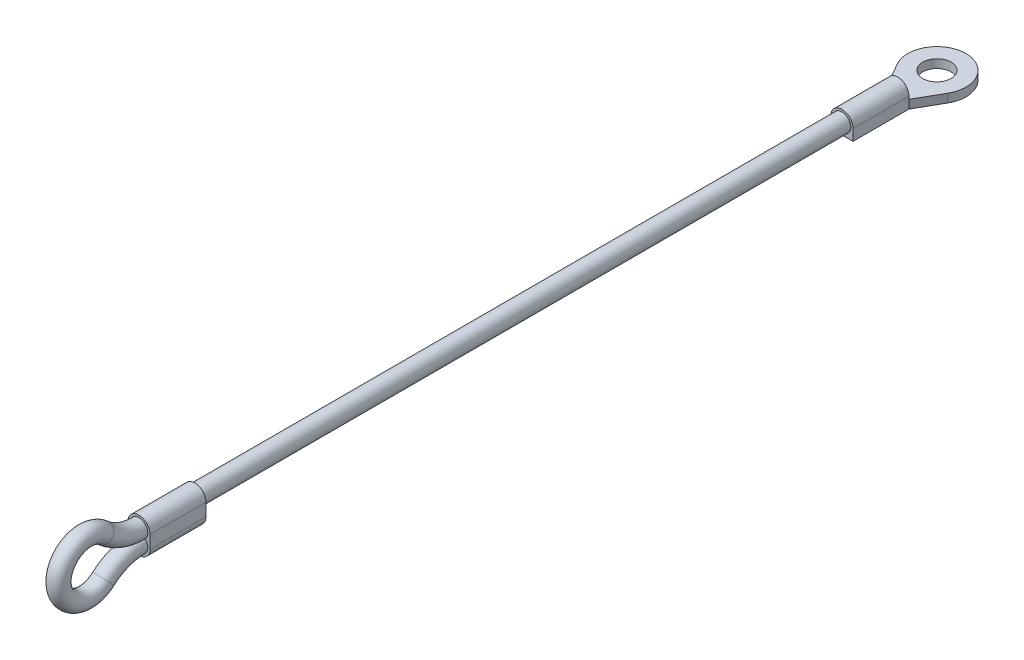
ISO-10303-21;
HEADER;
FILE_DESCRIPTION(('STEP AP214'),'2;1');
FILE_NAME('part.step','',(''),(''),'','','');
FILE_SCHEMA(('AUTOMOTIVE_DESIGN { 1 0 10303 214 1 1 1 1 }'));
ENDSEC;
DATA;
#1=APPLICATION_CONTEXT('core data for automotive mechanical design processes');
#2=APPLICATION_PROTOCOL_DEFINITION('international standard','automotive_design',2000,#1);
#3=PRODUCT_CONTEXT('',#1,'mechanical');
#4=PRODUCT('Part','Part','',(#3));
#5=PRODUCT_RELATED_PRODUCT_CATEGORY('part','',(#4));
#6=PRODUCT_DEFINITION_FORMATION('','',#4);
#7=PRODUCT_DEFINITION_CONTEXT('part definition',#1,'design');
#8=PRODUCT_DEFINITION('design','',#6,#7);
#9=PRODUCT_DEFINITION_SHAPE('','',#8);
#10=(LENGTH_UNIT() NAMED_UNIT(*) SI_UNIT(.MILLI.,.METRE.));
#11=(NAMED_UNIT(*) PLANE_ANGLE_UNIT() SI_UNIT($,.RADIAN.));
#12=(NAMED_UNIT(*) SI_UNIT($,.STERADIAN.) SOLID_ANGLE_UNIT());
#13=UNCERTAINTY_MEASURE_WITH_UNIT(LENGTH_MEASURE(1.E-05),#10,'distance_accuracy_value','');
#14=(GEOMETRIC_REPRESENTATION_CONTEXT(3) GLOBAL_UNCERTAINTY_ASSIGNED_CONTEXT((#13)) GLOBAL_UNIT_ASSIGNED_CONTEXT((#10,
#11,#12)) REPRESENTATION_CONTEXT('',''));
#15=CARTESIAN_POINT('',(0.,0.,0.));
#16=DIRECTION('',(0.,0.,1.));
#17=DIRECTION('',(1.,0.,0.));
#18=AXIS2_PLACEMENT_3D('',#15,#16,#17);
#19=CARTESIAN_POINT('',(0.,0.,-10.));
#20=DIRECTION('',(0.,0.,-1.));
#21=DIRECTION('',(-1.,0.,0.));
#22=AXIS2_PLACEMENT_3D('',#19,#20,#21);
#23=PLANE('',#22);
#24=DIRECTION('',(0.,-1.,0.));
#25=VECTOR('',#24,1.);
#26=CARTESIAN_POINT('',(1.99,0.,-10.));
#27=LINE('',#26,#25);
#28=CARTESIAN_POINT('',(1.99,0.,-10.));
#29=VERTEX_POINT('',#28);
#30=CARTESIAN_POINT('',(1.99,-0.47,-10.));
#31=VERTEX_POINT('',#30);
#32=EDGE_CURVE('E164',#29,#31,#27,.T.);
#33=ORIENTED_EDGE('',*,*,#32,.T.);
#34=DIRECTION('',(-1.,0.,0.));
#35=VECTOR('',#34,1.);
#36=CARTESIAN_POINT('',(-1.99,-0.47,-10.));
#37=LINE('',#36,#35);
#38=CARTESIAN_POINT('',(-1.99,-0.47,-10.));
#39=VERTEX_POINT('',#38);
#40=EDGE_CURVE('E133',#31,#39,#37,.T.);
#41=ORIENTED_EDGE('',*,*,#40,.T.);
#42=DIRECTION('',(0.,1.,0.));
#43=VECTOR('',#42,1.);
#44=CARTESIAN_POINT('',(-1.99,-1.99,-10.));
#45=LINE('',#44,#43);
#46=CARTESIAN_POINT('',(-1.99,0.,-10.));
#47=VERTEX_POINT('',#46);
#48=EDGE_CURVE('E168',#39,#47,#45,.T.);
#49=ORIENTED_EDGE('',*,*,#48,.T.);
#50=CARTESIAN_POINT('',(0.,0.,-10.));
#51=DIRECTION('',(0.,0.,-1.));
#52=DIRECTION('',(-1.,0.,0.));
#53=AXIS2_PLACEMENT_3D('',#50,#51,#52);
#54=CIRCLE('',#53,1.99);
#55=EDGE_CURVE('E161',#47,#29,#54,.T.);
#56=ORIENTED_EDGE('',*,*,#55,.T.);
#57=EDGE_LOOP('',(#33,#41,#49,#56));
#58=FACE_BOUND('',#57,.T.);
#59=ADVANCED_FACE('F33',(#58),#23,.T.);
#60=CARTESIAN_POINT('',(0.,0.,125.8));
#61=DIRECTION('',(0.,0.,-1.));
#62=DIRECTION('',(-1.,0.,0.));
#63=AXIS2_PLACEMENT_3D('',#60,#61,#62);
#64=CYLINDRICAL_SURFACE('',#63,1.59);
#65=CARTESIAN_POINT('',(0.,0.,115.8));
#66=DIRECTION('',(0.,0.,-1.));
#67=DIRECTION('',(0.,1.,0.));
#68=AXIS2_PLACEMENT_3D('',#65,#66,#67);
#69=CIRCLE('',#68,1.59);
#70=CARTESIAN_POINT('',(0.,1.59,115.8));
#71=VERTEX_POINT('',#70);
#72=EDGE_CURVE('E37',#71,#71,#69,.T.);
#73=ORIENTED_EDGE('',*,*,#72,.T.);
#74=EDGE_LOOP('',(#73));
#75=FACE_BOUND('',#74,.T.);
#76=CARTESIAN_POINT('',(0.,0.,0.));
#77=DIRECTION('',(0.,0.,1.));
#78=DIRECTION('',(1.,0.,0.));
#79=AXIS2_PLACEMENT_3D('',#76,#77,#78);
#80=CIRCLE('',#79,1.59);
#81=CARTESIAN_POINT('',(1.59,0.,0.));
#82=VERTEX_POINT('',#81);
#83=EDGE_CURVE('E190',#82,#82,#80,.T.);
#84=ORIENTED_EDGE('',*,*,#83,.T.);
#85=EDGE_LOOP('',(#84));
#86=FACE_BOUND('',#85,.T.);
#87=ADVANCED_FACE('F35',(#75,#86),#64,.T.);
#88=CARTESIAN_POINT('',(0.,1.99637760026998E-12,115.8));
#89=DIRECTION('',(0.,0.,1.));
#90=DIRECTION('',(0.,-1.,0.));
#91=AXIS2_PLACEMENT_3D('',#88,#89,#90);
#92=CYLINDRICAL_SURFACE('',#91,1.99);
#93=CARTESIAN_POINT('',(0.,2.01083362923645E-12,125.8));
#94=DIRECTION('',(0.,0.,-1.));
#95=DIRECTION('',(0.,1.,0.));
#96=AXIS2_PLACEMENT_3D('',#93,#94,#95);
#97=CIRCLE('',#96,1.99);
#98=CARTESIAN_POINT('',(-1.99,2.01107733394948E-12,125.8));
#99=VERTEX_POINT('',#98);
#100=CARTESIAN_POINT('',(1.99,2.01058992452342E-12,125.8));
#101=VERTEX_POINT('',#100);
#102=EDGE_CURVE('E202',#99,#101,#97,.T.);
#103=ORIENTED_EDGE('',*,*,#102,.T.);
#104=DIRECTION('',(0.,0.,1.));
#105=VECTOR('',#104,1.);
#106=CARTESIAN_POINT('',(1.99,1.99613389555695E-12,115.8));
#107=LINE('',#106,#105);
#108=CARTESIAN_POINT('',(1.99,1.99613389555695E-12,115.8));
#109=VERTEX_POINT('',#108);
#110=EDGE_CURVE('E218',#109,#101,#107,.T.);
#111=ORIENTED_EDGE('',*,*,#110,.F.);
#112=CARTESIAN_POINT('',(0.,1.99637760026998E-12,115.8));
#113=DIRECTION('',(0.,0.,-1.));
#114=DIRECTION('',(0.,1.,0.));
#115=AXIS2_PLACEMENT_3D('',#112,#113,#114);
#116=CIRCLE('',#115,1.99);
#117=CARTESIAN_POINT('',(-1.99,1.99662130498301E-12,115.8));
#118=VERTEX_POINT('',#117);
#119=EDGE_CURVE('E191',#118,#109,#116,.T.);
#120=ORIENTED_EDGE('',*,*,#119,.F.);
#121=DIRECTION('',(0.,0.,1.));
#122=VECTOR('',#121,1.);
#123=CARTESIAN_POINT('',(-1.99,1.99662130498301E-12,115.8));
#124=LINE('',#123,#122);
#125=EDGE_CURVE('E201',#118,#99,#124,.T.);
#126=ORIENTED_EDGE('',*,*,#125,.T.);
#127=EDGE_LOOP('',(#103,#111,#120,#126));
#128=FACE_BOUND('',#127,.T.);
#129=ADVANCED_FACE('F244',(#128),#92,.T.);
#130=CARTESIAN_POINT('',(1.99,1.99613389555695E-12,115.8));
#131=DIRECTION('',(-1.,0.,0.));
#132=DIRECTION('',(0.,-1.,0.));
#133=AXIS2_PLACEMENT_3D('',#130,#131,#132);
#134=PLANE('',#133);
#135=DIRECTION('',(0.,-1.,0.));
#136=VECTOR('',#135,1.);
#137=CARTESIAN_POINT('',(1.99,2.01058992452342E-12,125.8));
#138=LINE('',#137,#136);
#139=CARTESIAN_POINT('',(1.99,-2.26625258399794,125.8));
#140=VERTEX_POINT('',#139);
#141=EDGE_CURVE('E205',#101,#140,#138,.T.);
#142=ORIENTED_EDGE('',*,*,#141,.T.);
#143=DIRECTION('',(0.,0.,1.));
#144=VECTOR('',#143,1.);
#145=CARTESIAN_POINT('',(1.99,-2.26625258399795,115.8));
#146=LINE('',#145,#144);
#147=CARTESIAN_POINT('',(1.99,-2.26625258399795,115.8));
#148=VERTEX_POINT('',#147);
#149=EDGE_CURVE('E215',#148,#140,#146,.T.);
#150=ORIENTED_EDGE('',*,*,#149,.F.);
#151=DIRECTION('',(0.,-1.,0.));
#152=VECTOR('',#151,1.);
#153=CARTESIAN_POINT('',(1.99,1.99613389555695E-12,115.8));
#154=LINE('',#153,#152);
#155=EDGE_CURVE('E194',#109,#148,#154,.T.);
#156=ORIENTED_EDGE('',*,*,#155,.F.);
#157=ORIENTED_EDGE('',*,*,#110,.T.);
#158=EDGE_LOOP('',(#142,#150,#156,#157));
#159=FACE_BOUND('',#158,.T.);
#160=ADVANCED_FACE('F296',(#159),#134,.F.);
#161=CARTESIAN_POINT('',(0.,-2.26625258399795,115.8));
#162=DIRECTION('',(0.,0.,1.));
#163=DIRECTION('',(0.,-1.,0.));
#164=AXIS2_PLACEMENT_3D('',#161,#162,#163);
#165=CYLINDRICAL_SURFACE('',#164,1.99);
#166=CARTESIAN_POINT('',(0.,-2.26625258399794,125.8));
#167=DIRECTION('',(0.,0.,-1.));
#168=DIRECTION('',(0.,1.,0.));
#169=AXIS2_PLACEMENT_3D('',#166,#167,#168);
#170=CIRCLE('',#169,1.99);
#171=CARTESIAN_POINT('',(-1.99,-2.26625258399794,125.8));
#172=VERTEX_POINT('',#171);
#173=EDGE_CURVE('E207',#140,#172,#170,.T.);
#174=ORIENTED_EDGE('',*,*,#173,.T.);
#175=DIRECTION('',(0.,0.,1.));
#176=VECTOR('',#175,1.);
#177=CARTESIAN_POINT('',(-1.99,-2.26625258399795,115.8));
#178=LINE('',#177,#176);
#179=CARTESIAN_POINT('',(-1.99,-2.26625258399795,115.8));
#180=VERTEX_POINT('',#179);
#181=EDGE_CURVE('E212',#180,#172,#178,.T.);
#182=ORIENTED_EDGE('',*,*,#181,.F.);
#183=CARTESIAN_POINT('',(0.,-2.26625258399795,115.8));
#184=DIRECTION('',(0.,0.,-1.));
#185=DIRECTION('',(0.,1.,0.));
#186=AXIS2_PLACEMENT_3D('',#183,#184,#185);
#187=CIRCLE('',#186,1.99);
#188=EDGE_CURVE('E197',#148,#180,#187,.T.);
#189=ORIENTED_EDGE('',*,*,#188,.F.);
#190=ORIENTED_EDGE('',*,*,#149,.T.);
#191=EDGE_LOOP('',(#174,#182,#189,#190));
#192=FACE_BOUND('',#191,.T.);
#193=ADVANCED_FACE('F293',(#192),#165,.T.);
#194=CARTESIAN_POINT('',(-1.99,1.99662130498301E-12,115.8));
#195=DIRECTION('',(1.,0.,0.));
#196=DIRECTION('',(0.,1.,0.));
#197=AXIS2_PLACEMENT_3D('',#194,#195,#196);
#198=PLANE('',#197);
#199=DIRECTION('',(0.,1.,0.));
#200=VECTOR('',#199,1.);
#201=CARTESIAN_POINT('',(-1.99,2.01107733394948E-12,125.8));
#202=LINE('',#201,#200);
#203=EDGE_CURVE('E195',#172,#99,#202,.T.);
#204=ORIENTED_EDGE('',*,*,#203,.T.);
#205=ORIENTED_EDGE('',*,*,#125,.F.);
#206=DIRECTION('',(0.,1.,0.));
#207=VECTOR('',#206,1.);
#208=CARTESIAN_POINT('',(-1.99,1.99662130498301E-12,115.8));
#209=LINE('',#208,#207);
#210=EDGE_CURVE('E199',#180,#118,#209,.T.);
#211=ORIENTED_EDGE('',*,*,#210,.F.);
#212=ORIENTED_EDGE('',*,*,#181,.T.);
#213=EDGE_LOOP('',(#204,#205,#211,#212));
#214=FACE_BOUND('',#213,.T.);
#215=ADVANCED_FACE('F288',(#214),#198,.F.);
#216=CARTESIAN_POINT('',(0.,1.99637760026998E-12,115.8));
#217=DIRECTION('',(0.,0.,-1.));
#218=DIRECTION('',(0.,1.,0.));
#219=AXIS2_PLACEMENT_3D('',#216,#217,#218);
#220=PLANE('',#219);
#221=ORIENTED_EDGE('',*,*,#72,.F.);
#222=EDGE_LOOP('',(#221));
#223=FACE_BOUND('',#222,.T.);
#224=ORIENTED_EDGE('',*,*,#119,.T.);
#225=ORIENTED_EDGE('',*,*,#155,.T.);
#226=ORIENTED_EDGE('',*,*,#188,.T.);
#227=ORIENTED_EDGE('',*,*,#210,.T.);
#228=EDGE_LOOP('',(#224,#225,#226,#227));
#229=FACE_BOUND('',#228,.T.);
#230=ADVANCED_FACE('F255',(#223,#229),#220,.T.);
#231=CARTESIAN_POINT('',(0.,2.01083362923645E-12,125.8));
#232=DIRECTION('',(0.,0.,-1.));
#233=DIRECTION('',(0.,1.,0.));
#234=AXIS2_PLACEMENT_3D('',#231,#232,#233);
#235=PLANE('',#234);
#236=CARTESIAN_POINT('',(0.,0.,125.8));
#237=DIRECTION('',(0.,0.,1.));
#238=DIRECTION('',(1.,0.,0.));
#239=AXIS2_PLACEMENT_3D('',#236,#237,#238);
#240=CIRCLE('',#239,1.59);
#241=CARTESIAN_POINT('',(1.11540342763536,-1.13312629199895,125.8));
#242=VERTEX_POINT('',#241);
#243=CARTESIAN_POINT('',(-1.11540342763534,-1.13312629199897,125.8));
#244=VERTEX_POINT('',#243);
#245=EDGE_CURVE('E42',#242,#244,#240,.T.);
#246=ORIENTED_EDGE('',*,*,#245,.F.);
#247=CARTESIAN_POINT('',(0.,-2.26625258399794,125.8));
#248=DIRECTION('',(0.,0.,-1.));
#249=DIRECTION('',(1.,0.,0.));
#250=AXIS2_PLACEMENT_3D('',#247,#248,#249);
#251=CIRCLE('',#250,1.59);
#252=EDGE_CURVE('E56',#242,#244,#251,.T.);
#253=ORIENTED_EDGE('',*,*,#252,.T.);
#254=EDGE_LOOP('',(#246,#253));
#255=FACE_BOUND('',#254,.T.);
#256=ORIENTED_EDGE('',*,*,#102,.F.);
#257=ORIENTED_EDGE('',*,*,#203,.F.);
#258=ORIENTED_EDGE('',*,*,#173,.F.);
#259=ORIENTED_EDGE('',*,*,#141,.F.);
#260=EDGE_LOOP('',(#256,#257,#258,#259));
#261=FACE_BOUND('',#260,.T.);
#262=ADVANCED_FACE('F248',(#255,#261),#235,.F.);
#263=CARTESIAN_POINT('',(0.,-1.13312629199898,135.4));
#264=DIRECTION('',(-1.,0.,0.));
#265=DIRECTION('',(0.,0.,1.));
#266=AXIS2_PLACEMENT_3D('',#263,#264,#265);
#267=TOROIDAL_SURFACE('',#266,4.8,1.59);
#268=CARTESIAN_POINT('',(0.,-4.71083505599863,132.2));
#269=DIRECTION('',(0.,0.666666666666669,-0.745355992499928));
#270=DIRECTION('',(1.,0.,0.));
#271=AXIS2_PLACEMENT_3D('',#268,#269,#270);
#272=CIRCLE('',#271,1.59);
#273=CARTESIAN_POINT('',(0.,-5.89595108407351,131.14));
#274=VERTEX_POINT('',#273);
#275=EDGE_CURVE('E222',#274,#274,#272,.T.);
#276=CARTESIAN_POINT('',(0.,2.44458247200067,132.2));
#277=DIRECTION('',(0.,0.666666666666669,0.745355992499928));
#278=DIRECTION('',(1.,0.,0.));
#279=AXIS2_PLACEMENT_3D('',#276,#277,#278);
#280=CIRCLE('',#279,1.59);
#281=CARTESIAN_POINT('',(0.,3.62969850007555,131.14));
#282=VERTEX_POINT('',#281);
#283=EDGE_CURVE('E225',#282,#282,#280,.T.);
#284=CARTESIAN_POINT('',(0.,-1.13312629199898,135.4));
#285=DIRECTION('',(-1.,0.,0.));
#286=DIRECTION('',(0.,0.,1.));
#287=AXIS2_PLACEMENT_3D('',#284,#285,#286);
#288=CIRCLE('',#287,6.39);
#289=EDGE_CURVE('',#274,#282,#288,.T.);
#290=ORIENTED_EDGE('',*,*,#275,.F.);
#291=ORIENTED_EDGE('',*,*,#283,.T.);
#292=ORIENTED_EDGE('',*,*,#289,.T.);
#293=ORIENTED_EDGE('',*,*,#289,.F.);
#294=EDGE_LOOP('',(#290,#292,#291,#293));
#295=FACE_BOUND('',#294,.T.);
#296=ADVANCED_FACE('F246',(#295),#267,.T.);
#297=CARTESIAN_POINT('',(0.,9.6,125.8));
#298=DIRECTION('',(1.,0.,0.));
#299=DIRECTION('',(0.,0.,-1.));
#300=AXIS2_PLACEMENT_3D('',#297,#298,#299);
#301=TOROIDAL_SURFACE('',#300,9.6,1.59);
#302=ORIENTED_EDGE('',*,*,#283,.F.);
#303=EDGE_LOOP('',(#302));
#304=FACE_BOUND('',#303,.T.);
#305=CARTESIAN_POINT('',(1.11540342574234,-1.13312629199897,125.7998));
#306=CARTESIAN_POINT('',(1.11534851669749,-1.13312629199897,125.92773673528));
#307=CARTESIAN_POINT('',(1.1130814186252,-1.13312629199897,126.055686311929));
#308=CARTESIAN_POINT('',(1.10371453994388,-1.13312629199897,126.31155828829));
#309=CARTESIAN_POINT('',(1.09660901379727,-1.13312629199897,126.43948047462));
#310=CARTESIAN_POINT('',(1.0770425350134,-1.13312629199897,126.696418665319));
#311=CARTESIAN_POINT('',(1.06452051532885,-1.13312629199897,126.825430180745));
#312=CARTESIAN_POINT('',(1.03319430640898,-1.13312629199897,127.082627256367));
#313=CARTESIAN_POINT('',(1.01439338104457,-1.13312629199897,127.210813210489));
#314=CARTESIAN_POINT('',(0.966908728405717,-1.13312629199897,127.478005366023));
#315=CARTESIAN_POINT('',(0.937456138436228,-1.13312629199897,127.616883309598));
#316=CARTESIAN_POINT('',(0.883915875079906,-1.13312629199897,127.82263125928));
#317=CARTESIAN_POINT('',(0.864530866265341,-1.13312629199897,127.890724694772));
#318=CARTESIAN_POINT('',(0.82199602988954,-1.13312629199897,128.025715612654));
#319=CARTESIAN_POINT('',(0.79884765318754,-1.13312629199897,128.092613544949));
#320=CARTESIAN_POINT('',(0.744519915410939,-1.13312629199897,128.233542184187));
#321=CARTESIAN_POINT('',(0.712679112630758,-1.13312629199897,128.307321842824));
#322=CARTESIAN_POINT('',(0.641279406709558,-1.13312629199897,128.451146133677));
#323=CARTESIAN_POINT('',(0.601727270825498,-1.13312629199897,128.521193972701));
#324=CARTESIAN_POINT('',(0.528948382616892,-1.13312629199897,128.62943568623));
#325=CARTESIAN_POINT('',(0.498892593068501,-1.13312629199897,128.669741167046));
#326=CARTESIAN_POINT('',(0.433770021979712,-1.13312629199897,128.746140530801));
#327=CARTESIAN_POINT('',(0.398710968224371,-1.13312629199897,128.782240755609));
#328=CARTESIAN_POINT('',(0.335060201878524,-1.13312629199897,128.837058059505));
#329=CARTESIAN_POINT('',(0.308066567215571,-1.13312629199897,128.857612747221));
#330=CARTESIAN_POINT('',(0.251279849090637,-1.13312629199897,128.894433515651));
#331=CARTESIAN_POINT('',(0.22149152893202,-1.13312629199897,128.910706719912));
#332=CARTESIAN_POINT('',(0.165682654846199,-1.13312629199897,128.934797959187));
#333=CARTESIAN_POINT('',(0.140117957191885,-1.13312629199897,128.943660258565));
#334=CARTESIAN_POINT('',(0.0878641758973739,-1.13312629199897,128.956990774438));
#335=CARTESIAN_POINT('',(0.0611762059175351,-1.13312629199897,128.961463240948));
#336=CARTESIAN_POINT('',(0.00731772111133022,-1.13312629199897,128.965572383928));
#337=CARTESIAN_POINT('',(-0.0198542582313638,-1.13312629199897,128.965190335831));
#338=CARTESIAN_POINT('',(-0.0736951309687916,-1.13312629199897,128.959586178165));
#339=CARTESIAN_POINT('',(-0.100363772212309,-1.13312629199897,128.954361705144));
#340=CARTESIAN_POINT('',(-0.151195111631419,-1.13312629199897,128.939957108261));
#341=CARTESIAN_POINT('',(-0.175416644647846,-1.13312629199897,128.930979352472));
#342=CARTESIAN_POINT('',(-0.222373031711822,-1.13312629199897,128.909774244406));
#343=CARTESIAN_POINT('',(-0.245107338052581,-1.13312629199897,128.897545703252));
#344=CARTESIAN_POINT('',(-0.304759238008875,-1.13312629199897,128.860748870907));
#345=CARTESIAN_POINT('',(-0.340101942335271,-1.13312629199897,128.833635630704));
#346=CARTESIAN_POINT('',(-0.40628124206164,-1.13312629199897,128.77436880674));
#347=CARTESIAN_POINT('',(-0.437102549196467,-1.13312629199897,128.742198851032));
#348=CARTESIAN_POINT('',(-0.492718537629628,-1.13312629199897,128.67701365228));
#349=CARTESIAN_POINT('',(-0.517788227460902,-1.13312629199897,128.644229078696));
#350=CARTESIAN_POINT('',(-0.565060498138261,-1.13312629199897,128.576639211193));
#351=CARTESIAN_POINT('',(-0.587260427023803,-1.13312629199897,128.541832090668));
#352=CARTESIAN_POINT('',(-0.65027575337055,-1.13312629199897,128.435150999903));
#353=CARTESIAN_POINT('',(-0.687428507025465,-1.13312629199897,128.361116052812));
#354=CARTESIAN_POINT('',(-0.745434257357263,-1.13312629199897,128.230275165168));
#355=CARTESIAN_POINT('',(-0.767985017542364,-1.13312629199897,128.174182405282));
#356=CARTESIAN_POINT('',(-0.809859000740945,-1.13312629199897,128.060796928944));
#357=CARTESIAN_POINT('',(-0.82918188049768,-1.13312629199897,128.003504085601));
#358=CARTESIAN_POINT('',(-0.88316624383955,-1.13312629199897,127.830173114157));
#359=CARTESIAN_POINT('',(-0.913763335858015,-1.13312629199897,127.712874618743));
#360=CARTESIAN_POINT('',(-0.967023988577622,-1.13312629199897,127.475955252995));
#361=CARTESIAN_POINT('',(-0.989647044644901,-1.13312629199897,127.356325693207));
#362=CARTESIAN_POINT('',(-1.0284586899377,-1.13312629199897,127.116012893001));
#363=CARTESIAN_POINT('',(-1.0446457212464,-1.13312629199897,126.995329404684));
#364=CARTESIAN_POINT('',(-1.06818793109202,-1.13312629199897,126.78453669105));
#365=CARTESIAN_POINT('',(-1.07674400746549,-1.13312629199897,126.694556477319));
#366=CARTESIAN_POINT('',(-1.09119671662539,-1.13312629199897,126.514367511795));
#367=CARTESIAN_POINT('',(-1.09709289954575,-1.13312629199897,126.424158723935));
#368=CARTESIAN_POINT('',(-1.10635885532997,-1.13312629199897,126.244939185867));
#369=CARTESIAN_POINT('',(-1.10976438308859,-1.13312629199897,126.155930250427));
#370=CARTESIAN_POINT('',(-1.11428069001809,-1.13312629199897,125.977880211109));
#371=CARTESIAN_POINT('',(-1.11539214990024,-1.13312629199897,125.888839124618));
#372=CARTESIAN_POINT('',(-1.11540342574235,-1.13312629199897,125.7998));
#373=B_SPLINE_CURVE_WITH_KNOTS('',3,(#305,#306,#307,#308,#309,#310,#311,#312,#313,#314,#315,
#316,#317,#318,#319,#320,#321,#322,#323,#324,#325,#326,#327,#328,#329,#330,#331,#332,#333,#334,
#335,#336,#337,#338,#339,#340,#341,#342,#343,#344,#345,#346,#347,#348,#349,#350,#351,#352,#353,
#354,#355,#356,#357,#358,#359,#360,#361,#362,#363,#364,#365,#366,#367,#368,#369,#370,#371,#372),
.UNSPECIFIED.,.F.,.F.,(4,2,2,2,2,2,2,2,2,2,2,2,2,2,2,2,2,2,2,2,2,2,2,2,2,2,2,2,2,2,2,2,2,4),(0.,
0.383810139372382,0.76807684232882,1.1567936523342,1.54530871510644,1.9707126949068,
2.18302701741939,2.39525968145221,2.63604166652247,2.87661329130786,3.02716706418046,
3.17749076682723,3.27898827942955,3.38031583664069,3.461157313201,3.54192044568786,
3.62299518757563,3.70410952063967,3.78132200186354,3.85856276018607,3.99142265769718,
4.12472192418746,4.24834991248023,4.37209134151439,4.61994843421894,4.80123584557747,
4.98254252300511,5.34577733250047,5.71083149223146,6.07597396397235,6.34709439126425,
6.61826065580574,6.88545336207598,7.15256677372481),.UNSPECIFIED.);
#374=EDGE_CURVE('E11',#242,#244,#373,.T.);
#375=ORIENTED_EDGE('',*,*,#374,.F.);
#376=ORIENTED_EDGE('',*,*,#245,.T.);
#377=EDGE_LOOP('',(#375,#376));
#378=FACE_BOUND('',#377,.T.);
#379=ADVANCED_FACE('F235',(#304,#378),#301,.T.);
#380=CARTESIAN_POINT('',(0.,-11.8662525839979,125.8));
#381=DIRECTION('',(1.,0.,0.));
#382=DIRECTION('',(0.,0.,-1.));
#383=AXIS2_PLACEMENT_3D('',#380,#381,#382);
#384=TOROIDAL_SURFACE('',#383,9.6,1.59);
#385=ORIENTED_EDGE('',*,*,#275,.T.);
#386=EDGE_LOOP('',(#385));
#387=FACE_BOUND('',#386,.T.);
#388=ORIENTED_EDGE('',*,*,#252,.F.);
#389=ORIENTED_EDGE('',*,*,#374,.T.);
#390=EDGE_LOOP('',(#388,#389));
#391=FACE_BOUND('',#390,.T.);
#392=ADVANCED_FACE('F238',(#387,#391),#384,.T.);
#393=CARTESIAN_POINT('',(0.,0.,-10.));
#394=DIRECTION('',(0.,0.,1.));
#395=DIRECTION('',(1.,0.,0.));
#396=AXIS2_PLACEMENT_3D('',#393,#394,#395);
#397=CYLINDRICAL_SURFACE('',#396,1.99);
#398=CARTESIAN_POINT('',(0.,0.,0.));
#399=DIRECTION('',(0.,0.,-1.));
#400=DIRECTION('',(-1.,0.,0.));
#401=AXIS2_PLACEMENT_3D('',#398,#399,#400);
#402=CIRCLE('',#401,1.99);
#403=CARTESIAN_POINT('',(-1.99,0.,0.));
#404=VERTEX_POINT('',#403);
#405=CARTESIAN_POINT('',(1.99,0.,0.));
#406=VERTEX_POINT('',#405);
#407=EDGE_CURVE('E159',#404,#406,#402,.T.);
#408=ORIENTED_EDGE('',*,*,#407,.T.);
#409=DIRECTION('',(0.,0.,1.));
#410=VECTOR('',#409,1.);
#411=CARTESIAN_POINT('',(1.99,0.,-10.));
#412=LINE('',#411,#410);
#413=EDGE_CURVE('E187',#29,#406,#412,.T.);
#414=ORIENTED_EDGE('',*,*,#413,.F.);
#415=ORIENTED_EDGE('',*,*,#55,.F.);
#416=DIRECTION('',(0.,0.,1.));
#417=VECTOR('',#416,1.);
#418=CARTESIAN_POINT('',(-1.99,0.,-10.));
#419=LINE('',#418,#417);
#420=EDGE_CURVE('E170',#47,#404,#419,.T.);
#421=ORIENTED_EDGE('',*,*,#420,.T.);
#422=EDGE_LOOP('',(#408,#414,#415,#421));
#423=FACE_BOUND('',#422,.T.);
#424=ADVANCED_FACE('F242',(#423),#397,.T.);
#425=CARTESIAN_POINT('',(1.99,0.,-10.));
#426=DIRECTION('',(-1.,0.,0.));
#427=DIRECTION('',(0.,-1.,0.));
#428=AXIS2_PLACEMENT_3D('',#425,#426,#427);
#429=PLANE('',#428);
#430=DIRECTION('',(0.,-1.,0.));
#431=VECTOR('',#430,1.);
#432=CARTESIAN_POINT('',(1.99,0.,0.));
#433=LINE('',#432,#431);
#434=CARTESIAN_POINT('',(1.99,-1.99,0.));
#435=VERTEX_POINT('',#434);
#436=EDGE_CURVE('E173',#406,#435,#433,.T.);
#437=ORIENTED_EDGE('',*,*,#436,.T.);
#438=DIRECTION('',(0.,0.,1.));
#439=VECTOR('',#438,1.);
#440=CARTESIAN_POINT('',(1.99,-1.99,-10.));
#441=LINE('',#440,#439);
#442=CARTESIAN_POINT('',(1.99,-1.99,-10.));
#443=VERTEX_POINT('',#442);
#444=EDGE_CURVE('E184',#443,#435,#441,.T.);
#445=ORIENTED_EDGE('',*,*,#444,.F.);
#446=DIRECTION('',(0.,-1.,0.));
#447=VECTOR('',#446,1.);
#448=CARTESIAN_POINT('',(1.99,-0.47,-10.));
#449=LINE('',#448,#447);
#450=EDGE_CURVE('E157',#31,#443,#449,.T.);
#451=ORIENTED_EDGE('',*,*,#450,.F.);
#452=ORIENTED_EDGE('',*,*,#32,.F.);
#453=ORIENTED_EDGE('',*,*,#413,.T.);
#454=EDGE_LOOP('',(#437,#445,#451,#452,#453));
#455=FACE_BOUND('',#454,.T.);
#456=ADVANCED_FACE('F279',(#455),#429,.F.);
#457=CARTESIAN_POINT('',(0.,-1.99,-10.));
#458=DIRECTION('',(0.,1.,0.));
#459=DIRECTION('',(0.,0.,1.));
#460=AXIS2_PLACEMENT_3D('',#457,#458,#459);
#461=PLANE('',#460);
#462=DIRECTION('',(-1.,0.,0.));
#463=VECTOR('',#462,1.);
#464=CARTESIAN_POINT('',(0.,-1.99,0.));
#465=LINE('',#464,#463);
#466=CARTESIAN_POINT('',(-1.99,-1.99,0.));
#467=VERTEX_POINT('',#466);
#468=EDGE_CURVE('E176',#435,#467,#465,.T.);
#469=ORIENTED_EDGE('',*,*,#468,.T.);
#470=DIRECTION('',(0.,0.,1.));
#471=VECTOR('',#470,1.);
#472=CARTESIAN_POINT('',(-1.99,-1.99,-10.));
#473=LINE('',#472,#471);
#474=CARTESIAN_POINT('',(-1.99,-1.99,-10.));
#475=VERTEX_POINT('',#474);
#476=EDGE_CURVE('E181',#475,#467,#473,.T.);
#477=ORIENTED_EDGE('',*,*,#476,.F.);
#478=DIRECTION('',(-0.496859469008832,0.,-0.867831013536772));
#479=VECTOR('',#478,1.);
#480=CARTESIAN_POINT('',(-4.5170604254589,-1.99,-14.413846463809));
#481=LINE('',#480,#479);
#482=CARTESIAN_POINT('',(-4.5170604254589,-1.99,-14.413846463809));
#483=VERTEX_POINT('',#482);
#484=EDGE_CURVE('E153',#475,#483,#481,.T.);
#485=ORIENTED_EDGE('',*,*,#484,.T.);
#486=CARTESIAN_POINT('',(0.,-1.99,-17.));
#487=DIRECTION('',(0.,-1.,0.));
#488=DIRECTION('',(0.,0.,1.));
#489=AXIS2_PLACEMENT_3D('',#486,#487,#488);
#490=CIRCLE('',#489,5.205);
#491=CARTESIAN_POINT('',(4.5170604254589,-1.99,-14.413846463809));
#492=VERTEX_POINT('',#491);
#493=EDGE_CURVE('E129',#483,#492,#490,.T.);
#494=ORIENTED_EDGE('',*,*,#493,.T.);
#495=DIRECTION('',(-0.496859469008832,0.,0.867831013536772));
#496=VECTOR('',#495,1.);
#497=CARTESIAN_POINT('',(1.99,-1.99,-10.));
#498=LINE('',#497,#496);
#499=EDGE_CURVE('E143',#492,#443,#498,.T.);
#500=ORIENTED_EDGE('',*,*,#499,.T.);
#501=ORIENTED_EDGE('',*,*,#444,.T.);
#502=EDGE_LOOP('',(#469,#477,#485,#494,#500,#501));
#503=FACE_BOUND('',#502,.T.);
#504=CARTESIAN_POINT('',(0.,-1.99,-17.));
#505=DIRECTION('',(0.,-1.,0.));
#506=DIRECTION('',(0.,0.,-1.));
#507=AXIS2_PLACEMENT_3D('',#504,#505,#506);
#508=CIRCLE('',#507,2.54);
#509=CARTESIAN_POINT('',(0.,-1.99,-19.54));
#510=VERTEX_POINT('',#509);
#511=EDGE_CURVE('E148',#510,#510,#508,.T.);
#512=ORIENTED_EDGE('',*,*,#511,.F.);
#513=EDGE_LOOP('',(#512));
#514=FACE_BOUND('',#513,.T.);
#515=ADVANCED_FACE('F275',(#503,#514),#461,.F.);
#516=CARTESIAN_POINT('',(-1.99,-1.99,-10.));
#517=DIRECTION('',(1.,0.,0.));
#518=DIRECTION('',(0.,1.,0.));
#519=AXIS2_PLACEMENT_3D('',#516,#517,#518);
#520=PLANE('',#519);
#521=DIRECTION('',(0.,1.,0.));
#522=VECTOR('',#521,1.);
#523=CARTESIAN_POINT('',(-1.99,-1.99,0.));
#524=LINE('',#523,#522);
#525=EDGE_CURVE('E165',#467,#404,#524,.T.);
#526=ORIENTED_EDGE('',*,*,#525,.T.);
#527=ORIENTED_EDGE('',*,*,#420,.F.);
#528=ORIENTED_EDGE('',*,*,#48,.F.);
#529=EDGE_CURVE('E141',#475,#39,#45,.T.);
#530=ORIENTED_EDGE('',*,*,#529,.F.);
#531=ORIENTED_EDGE('',*,*,#476,.T.);
#532=EDGE_LOOP('',(#526,#527,#528,#530,#531));
#533=FACE_BOUND('',#532,.T.);
#534=ADVANCED_FACE('F271',(#533),#520,.F.);
#535=CARTESIAN_POINT('',(0.,0.,0.));
#536=DIRECTION('',(0.,0.,-1.));
#537=DIRECTION('',(-1.,0.,0.));
#538=AXIS2_PLACEMENT_3D('',#535,#536,#537);
#539=PLANE('',#538);
#540=ORIENTED_EDGE('',*,*,#83,.F.);
#541=EDGE_LOOP('',(#540));
#542=FACE_BOUND('',#541,.T.);
#543=ORIENTED_EDGE('',*,*,#407,.F.);
#544=ORIENTED_EDGE('',*,*,#525,.F.);
#545=ORIENTED_EDGE('',*,*,#468,.F.);
#546=ORIENTED_EDGE('',*,*,#436,.F.);
#547=EDGE_LOOP('',(#543,#544,#545,#546));
#548=FACE_BOUND('',#547,.T.);
#549=ADVANCED_FACE('F268',(#542,#548),#539,.F.);
#550=CARTESIAN_POINT('',(-4.5170604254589,-0.47,-14.413846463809));
#551=DIRECTION('',(-0.867831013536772,0.,0.496859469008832));
#552=DIRECTION('',(0.496859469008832,0.,0.867831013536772));
#553=AXIS2_PLACEMENT_3D('',#550,#551,#552);
#554=PLANE('',#553);
#555=ORIENTED_EDGE('',*,*,#484,.F.);
#556=ORIENTED_EDGE('',*,*,#529,.T.);
#557=DIRECTION('',(-0.496859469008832,0.,-0.867831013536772));
#558=VECTOR('',#557,1.);
#559=CARTESIAN_POINT('',(-4.5170604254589,-0.47,-14.413846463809));
#560=LINE('',#559,#558);
#561=CARTESIAN_POINT('',(-4.5170604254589,-0.47,-14.413846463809));
#562=VERTEX_POINT('',#561);
#563=EDGE_CURVE('E49',#39,#562,#560,.T.);
#564=ORIENTED_EDGE('',*,*,#563,.T.);
#565=DIRECTION('',(0.,-1.,0.));
#566=VECTOR('',#565,1.);
#567=CARTESIAN_POINT('',(-4.5170604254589,-0.47,-14.413846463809));
#568=LINE('',#567,#566);
#569=EDGE_CURVE('E125',#562,#483,#568,.T.);
#570=ORIENTED_EDGE('',*,*,#569,.T.);
#571=EDGE_LOOP('',(#555,#556,#564,#570));
#572=FACE_BOUND('',#571,.T.);
#573=ADVANCED_FACE('F139',(#572),#554,.T.);
#574=CARTESIAN_POINT('',(1.99,-0.47,-10.));
#575=DIRECTION('',(0.867831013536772,0.,0.496859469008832));
#576=DIRECTION('',(0.496859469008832,0.,-0.867831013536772));
#577=AXIS2_PLACEMENT_3D('',#574,#575,#576);
#578=PLANE('',#577);
#579=ORIENTED_EDGE('',*,*,#499,.F.);
#580=DIRECTION('',(0.,-1.,0.));
#581=VECTOR('',#580,1.);
#582=CARTESIAN_POINT('',(4.5170604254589,-0.47,-14.413846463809));
#583=LINE('',#582,#581);
#584=CARTESIAN_POINT('',(4.5170604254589,-0.47,-14.413846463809));
#585=VERTEX_POINT('',#584);
#586=EDGE_CURVE('E132',#585,#492,#583,.T.);
#587=ORIENTED_EDGE('',*,*,#586,.F.);
#588=DIRECTION('',(-0.496859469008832,0.,0.867831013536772));
#589=VECTOR('',#588,1.);
#590=CARTESIAN_POINT('',(1.99,-0.47,-10.));
#591=LINE('',#590,#589);
#592=EDGE_CURVE('E137',#585,#31,#591,.T.);
#593=ORIENTED_EDGE('',*,*,#592,.T.);
#594=ORIENTED_EDGE('',*,*,#450,.T.);
#595=EDGE_LOOP('',(#579,#587,#593,#594));
#596=FACE_BOUND('',#595,.T.);
#597=ADVANCED_FACE('F412',(#596),#578,.T.);
#598=CARTESIAN_POINT('',(0.,-0.47,-17.));
#599=DIRECTION('',(0.,-1.,0.));
#600=DIRECTION('',(0.,0.,-1.));
#601=AXIS2_PLACEMENT_3D('',#598,#599,#600);
#602=CYLINDRICAL_SURFACE('',#601,5.205);
#603=ORIENTED_EDGE('',*,*,#493,.F.);
#604=ORIENTED_EDGE('',*,*,#569,.F.);
#605=CARTESIAN_POINT('',(0.,-0.47,-17.));
#606=DIRECTION('',(0.,-1.,0.));
#607=DIRECTION('',(0.,0.,1.));
#608=AXIS2_PLACEMENT_3D('',#605,#606,#607);
#609=CIRCLE('',#608,5.205);
#610=EDGE_CURVE('E127',#562,#585,#609,.T.);
#611=ORIENTED_EDGE('',*,*,#610,.T.);
#612=ORIENTED_EDGE('',*,*,#586,.T.);
#613=EDGE_LOOP('',(#603,#604,#611,#612));
#614=FACE_BOUND('',#613,.T.);
#615=ADVANCED_FACE('F126',(#614),#602,.T.);
#616=CARTESIAN_POINT('',(0.,-0.47,-17.));
#617=DIRECTION('',(0.,1.,0.));
#618=DIRECTION('',(0.,0.,1.));
#619=AXIS2_PLACEMENT_3D('',#616,#617,#618);
#620=PLANE('',#619);
#621=CARTESIAN_POINT('',(0.,-0.47,-17.));
#622=DIRECTION('',(0.,-1.,0.));
#623=DIRECTION('',(0.,0.,-1.));
#624=AXIS2_PLACEMENT_3D('',#621,#622,#623);
#625=CIRCLE('',#624,2.54);
#626=CARTESIAN_POINT('',(0.,-0.47,-19.54));
#627=VERTEX_POINT('',#626);
#628=EDGE_CURVE('E155',#627,#627,#625,.T.);
#629=ORIENTED_EDGE('',*,*,#628,.T.);
#630=EDGE_LOOP('',(#629));
#631=FACE_BOUND('',#630,.T.);
#632=ORIENTED_EDGE('',*,*,#563,.F.);
#633=ORIENTED_EDGE('',*,*,#40,.F.);
#634=ORIENTED_EDGE('',*,*,#592,.F.);
#635=ORIENTED_EDGE('',*,*,#610,.F.);
#636=EDGE_LOOP('',(#632,#633,#634,#635));
#637=FACE_BOUND('',#636,.T.);
#638=ADVANCED_FACE('F136',(#631,#637),#620,.T.);
#639=CARTESIAN_POINT('',(0.,-0.47,-17.));
#640=DIRECTION('',(0.,-1.,0.));
#641=DIRECTION('',(0.,0.,-1.));
#642=AXIS2_PLACEMENT_3D('',#639,#640,#641);
#643=CYLINDRICAL_SURFACE('',#642,2.54);
#644=ORIENTED_EDGE('',*,*,#628,.F.);
#645=EDGE_LOOP('',(#644));
#646=FACE_BOUND('',#645,.T.);
#647=ORIENTED_EDGE('',*,*,#511,.T.);
#648=EDGE_LOOP('',(#647));
#649=FACE_BOUND('',#648,.T.);
#650=ADVANCED_FACE('F429',(#646,#649),#643,.F.);
#651=CLOSED_SHELL('',(#59,#87,#129,#160,#193,#215,#230,#262,#296,#379,#392,#424,#456,#515,#534,
#549,#573,#597,#615,#638,#650));
#652=MANIFOLD_SOLID_BREP('B2',#651);
#653=ADVANCED_BREP_SHAPE_REPRESENTATION('',(#18,#652),#14);
#654=SHAPE_DEFINITION_REPRESENTATION(#9,#653);
ENDSEC;
END-ISO-10303-21;
